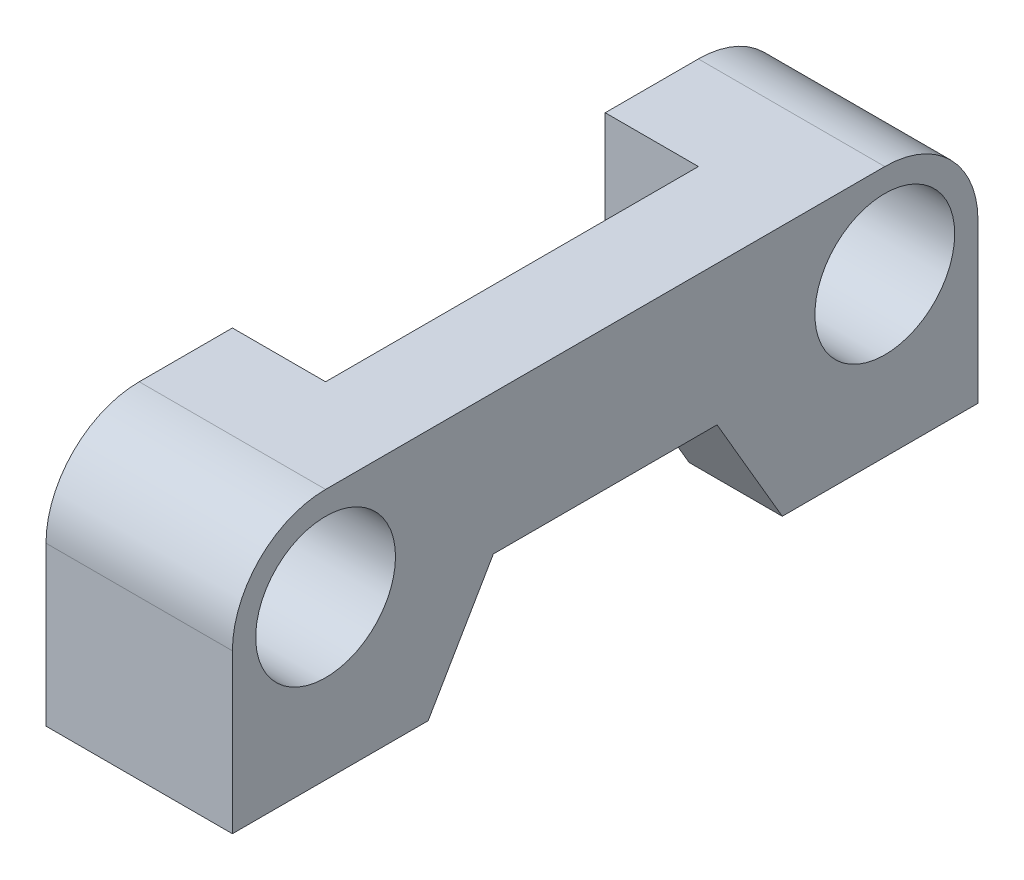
from build123d import *

# Parameters (mm, degrees)
SKETCH1_R           = 7.5
BOSS_EXTRUDE1_DEPTH = 20
SKETCH2_W           = 10
SKETCH2_H           = 40
CUT_EXTRUDE1_DEPTH  = 53.239831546


with BuildPart() as part:
    # Sketch1 → Boss-Extrude1 (new body)
    with BuildSketch(Plane(origin=(0, 0, 0), x_dir=(0, 0, -1), z_dir=(1, 0, 0))):
        with BuildLine():
            Line((-19, -13.5), (-12, -1.5))
            Line((-12, -1.5), (12, -1.5))
            Line((12, -1.5), (19, -13.5))
            Line((19, -13.5), (40, -13.5))
            Line((40, -13.5), (40, 3.5))
            ThreePointArc((40, 3.5), (37.071067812, 10.571067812), (30, 13.5))
            Line((30, 13.5), (-30, 13.5))
            ThreePointArc((-30, 13.5), (-37.071067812, 10.571067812), (-40, 3.5))
            Line((-40, 3.5), (-40, -13.5))
            Line((-40, -13.5), (-19, -13.5))
        make_face()
        with Locations((-30, 3.5)):
            Circle(SKETCH1_R, mode=Mode.SUBTRACT)
        with Locations((30, 3.5)):
            Circle(SKETCH1_R, mode=Mode.SUBTRACT)
    extrude(amount=BOSS_EXTRUDE1_DEPTH)

    # Sketch2 → Cut-Extrude1 (cut, through all)
    with BuildSketch(Plane(origin=(0, 13.5, 0), x_dir=(1, 0, 0), z_dir=(0, 1, 0))):
        with Locations((5, 0)):
            Rectangle(SKETCH2_W, SKETCH2_H)
    extrude(amount=-CUT_EXTRUDE1_DEPTH, mode=Mode.SUBTRACT)


solid = part.part
